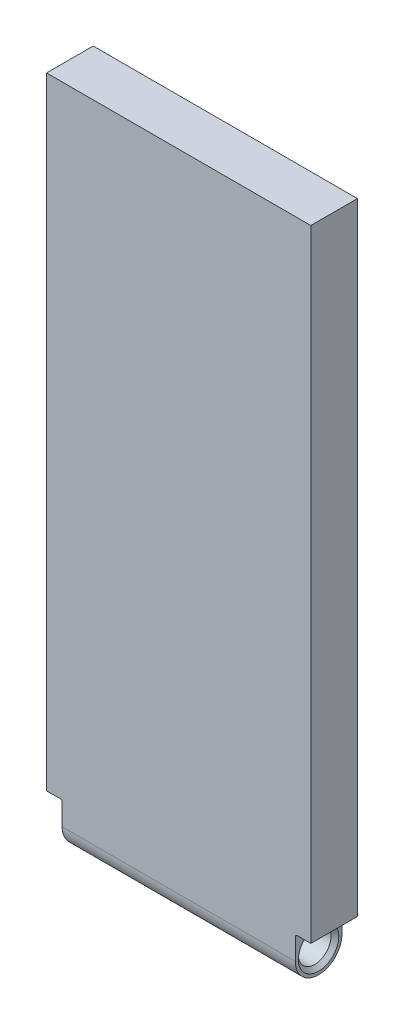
from build123d import *

# Parameters (mm, degrees)
SKETCH_1_W          = 34
SKETCH_1_H          = 80
EXTRUDE_1_DEPTH     = 7
SKETCH_2_W          = 2
SKETCH_2_H          = 80
CUT_EXTRUDE_1_DEPTH = 1
SKETCH_3_R          = 2.1
EXTRUDE_2_DEPTH     = 15
SKETCH_5_W          = 30
SKETCH_5_H          = 80
CUT_EXTRUDE_2_DEPTH = 1
FILLET_1_R          = 0.25
CHAMFER_1_SIZE      = 0.5


with BuildPart() as part:
    # Sketch 1 → Extrude 1 (new body)
    with BuildSketch(Plane.XY):
        with Locations((0, 40)):
            Rectangle(SKETCH_1_W, SKETCH_1_H)
    extrude(amount=-EXTRUDE_1_DEPTH)

    # Sketch 2 → Cut-Extrude 1 (cut)
    with BuildSketch(Plane(origin=(0, 0, -7), x_dir=(-1, 0, 0), z_dir=(0, 0, -1))):
        with Locations((-16, 40)):
            Rectangle(SKETCH_2_W, SKETCH_2_H)
        with Locations((16, 40)):
            Rectangle(SKETCH_2_W, SKETCH_2_H)
    extrude(amount=-CUT_EXTRUDE_1_DEPTH, mode=Mode.SUBTRACT)

    # Sketch 3 → Extrude 2 (add, symmetric)
    with BuildSketch(Plane(origin=(0, 0, 0), x_dir=(0, 0, -1), z_dir=(1, 0, 0))):
        with BuildLine():
            Line((0, 0), (0, -3))
            ThreePointArc((0, -3), (3, -6), (6, -3))
            Line((6, -3), (6, 0))
            Line((6, 0), (0, 0))
        make_face()
        with Locations((3, -3)):
            Circle(SKETCH_3_R, mode=Mode.SUBTRACT)
    extrude(amount=EXTRUDE_2_DEPTH, both=True)

    # Sketch 5 → Cut-Extrude 2 (cut)
    with BuildSketch(Plane(origin=(0, 0, -7), x_dir=(-1, 0, 0), z_dir=(0, 0, -1))):
        with Locations((0, 40)):
            Rectangle(SKETCH_5_W, SKETCH_5_H)
    extrude(amount=-CUT_EXTRUDE_2_DEPTH, mode=Mode.SUBTRACT)

    # Fillet 1
    fillet_1_edges = [part.edges().sort_by_distance(p)[0] for p in [
        (-15, 0, -3),
        (15, 0, -3),
    ]]
    fillet(fillet_1_edges, radius=FILLET_1_R)

    # Chamfer 1
    chamfer_1_edges = [part.edges().sort_by_distance(p)[0] for p in [
        (-15, -3, -0.9),
        (15, -3, -0.9),
    ]]
    chamfer(chamfer_1_edges, length=CHAMFER_1_SIZE)


solid = part.part
